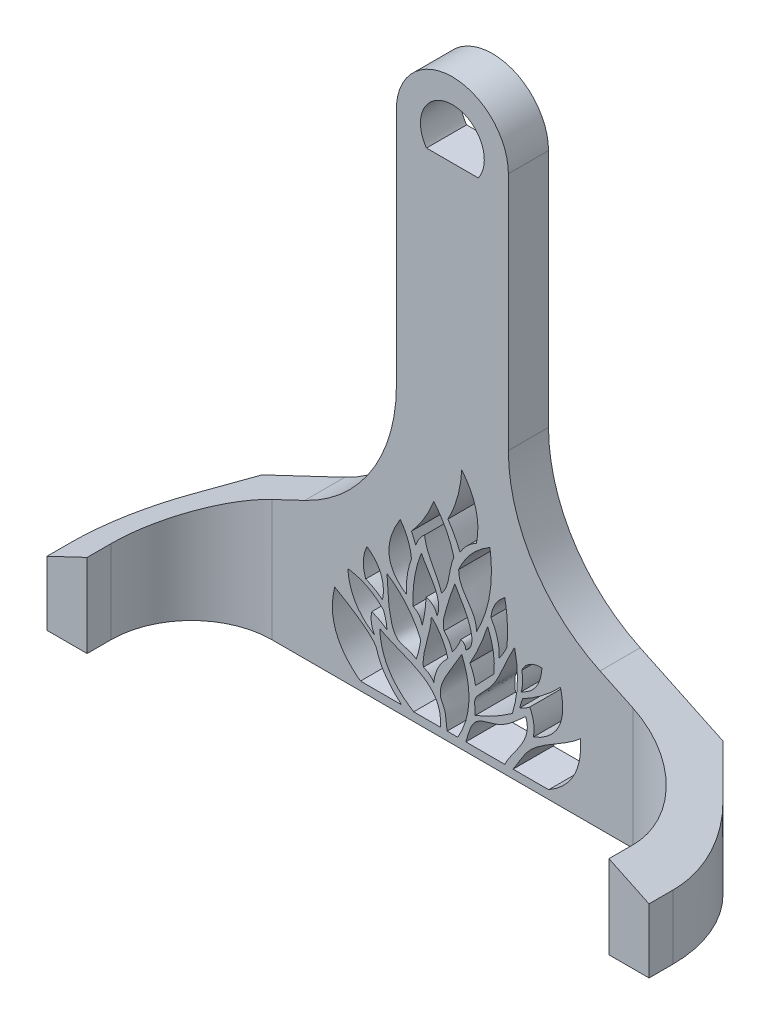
from build123d import *

# Parameters (mm, degrees)
BOSS_EXTRUDE1_DEPTH     = 10
BOSS_EXTRUDE3_DEPTH     = 26
FILLET1_R               = 20
CUT_EXTRUDE1_DEPTH      = 167.260646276
CUT_EXTRUDE3_DEPTH      = 165.385530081
CUT_EXTRUDE3_DEPTH_BACK = 165.385530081


with BuildPart() as part:
    # Sketch1 → Boss-Extrude1 (new body)
    with BuildSketch(Plane.XY):
        with BuildLine():
            Line((-75, 0), (75, 0))
            Line((75, 0), (75, 16))
            Line((75, 16), (36.787123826, 34.151898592))
            ThreePointArc((36.787123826, 34.151898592), (20.13790862, 48.911177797), (13.95, 70.282712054))
            Line((13.95, 70.282712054), (13.95, 130))
            ThreePointArc((13.95, 130), (0, 143.95), (-13.95, 130))
            Line((-13.95, 130), (-13.95, 70.282712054))
            ThreePointArc((-13.95, 70.282712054), (-20.13790862, 48.911177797), (-36.787123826, 34.151898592))
            Line((-36.787123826, 34.151898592), (-75, 16))
            Line((-75, 16), (-75, 0))
        make_face()
        with BuildLine():
            Line((6.448255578, 125.35), (-6.448255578, 125.35))
            ThreePointArc((-6.448255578, 125.35), (0, 137.95), (6.448255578, 125.35))
        make_face(mode=Mode.SUBTRACT)
    extrude(amount=BOSS_EXTRUDE1_DEPTH)

    # Sketch3 → Boss-Extrude3 (add)
    with BuildSketch(Plane.XY.offset(10)):
        Polygon((-65, 20.75020475), (-65, 0), (-75, 0), (-75, 16), align=None)
        Polygon((65, 20.75020475), (65, 0), (75, 0), (75, 16), align=None)
    extrude(amount=BOSS_EXTRUDE3_DEPTH)

    # Fillet1
    fillet1_edges = [part.edges().sort_by_distance(p)[0] for p in [
        (-65, 10.375102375, 10),
        (65, 10.375102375, 10),
    ]]
    fillet(fillet1_edges, radius=FILLET1_R)

    # Sketch4 → Cut-Extrude1 (cut, through all)
    with BuildSketch(Plane.XZ):
        with BuildLine():
            Line((57.426406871, 0), (66.213203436, 8.786796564))
            ThreePointArc((66.213203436, 8.786796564), (72.716385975, 18.519497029), (75, 30))
            Line((75, 30), (75, 0))
            Line((75, 0), (57.426406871, 0))
        make_face()
        with BuildLine():
            Line((-57.426406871, 0), (-66.213203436, 8.786796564))
            ThreePointArc((-66.213203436, 8.786796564), (-72.716385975, 18.519497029), (-75, 30))
            Line((-75, 30), (-75, 0))
            Line((-75, 0), (-57.426406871, 0))
        make_face()
    extrude(amount=-CUT_EXTRUDE1_DEPTH, mode=Mode.SUBTRACT)

    # Sketch6 → Cut-Extrude3 (cut, two sides: drawn at the far end of the back side and taken through both)
    with BuildSketch(Plane.XY.offset(10).offset(-CUT_EXTRUDE3_DEPTH_BACK)):
        with BuildLine():
            Line((-9.63566394, 2.118822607), (-3.00934449, 2.118822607))
            add(Edge.make_bspline(
                [(-3.00934449, 2.118822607), (-2.107442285, 11.474091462), (-12.085295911, 12.52213364), (-18.097304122, 15.851318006)],
                knots=[0, 0, 0, 0, 1, 1, 1, 1], degree=3))
            add(Edge.make_bspline(
                [(-18.097304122, 15.851318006), (-17.803389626, 7.204871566), (-9.63566394, 2.118822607)],
                knots=[0, 0, 0, 1, 1, 1], degree=2))
        make_face()
        with BuildLine():
            Line((-1.30404169, 2.118822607), (1.351358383, 2.118822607))
            add(Edge.make_bspline(
                [(1.351358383, 2.118822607), (6.36439821, 10.813130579), (2.334063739, 20.500374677)],
                knots=[0, 0, 0, 1, 1, 1], degree=2))
            add(Edge.make_bspline(
                [(-1.30404169, 2.118822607), (-1.557133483, 3.493887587), (-1.53346335, 6.456941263), (-3.104096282, 8.349356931), (-2.851899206, 12.679161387), (-0.747048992, 15.064158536), (2.334063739, 20.500374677)],
                knots=[0, 0, 0, 0, 0.160123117, 0.338694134, 0.422681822, 1, 1, 1, 1], degree=3))
        make_face()
        with BuildLine():
            Line((3.348998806, 2.118822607), (13.053704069, 2.118822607))
            add(Edge.make_bspline(
                [(13.053704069, 2.118822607), (14.704324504, 5.91266318), (20.227331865, 10.265404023), (18.244398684, 15.019310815)],
                knots=[0, 0, 0, 0, 1, 1, 1, 1], degree=3))
            add(Edge.make_bspline(
                [(3.348998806, 2.118822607), (3.884552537, 3.785314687), (5.003478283, 8.701947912), (12.164916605, 9.253023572), (15.545270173, 12.633307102), (18.244398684, 15.019310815)],
                knots=[0, 0, 0, 0, 0.218875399, 0.535489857, 1, 1, 1, 1], degree=3))
        make_face()
        with BuildLine():
            Line((15.121579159, 2.118822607), (23.99307662, 2.118822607))
            add(Edge.make_bspline(
                [(31.877169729, 17.067352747), (32.64699268, 7.173438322), (23.99307662, 2.118822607)],
                knots=[0, 0, 0, 1, 1, 1], degree=2))
            add(Edge.make_bspline(
                [(15.121579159, 2.118822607), (17.083073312, 5.124506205), (19.642350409, 10.531443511), (28.671639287, 14.037293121), (31.877169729, 17.067352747)],
                knots=[0, 0, 0, 0, 0.346729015, 1, 1, 1, 1], degree=3))
        make_face()
        with BuildLine():
            Line((-12.687920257, 2.118822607), (-22.898361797, 2.118822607))
            add(Edge.make_bspline(
                [(-29.319313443, 19.211715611), (-31.923006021, 8.841688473), (-22.898361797, 2.118822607)],
                knots=[0, 0, 0, 1, 1, 1], degree=2))
            add(Edge.make_bspline(
                [(-12.687920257, 2.118822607), (-15.378895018, 4.403578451), (-18.780871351, 9.255832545), (-18.462334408, 12.773018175), (-26.982694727, 17.914095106), (-29.319313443, 19.211715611)],
                knots=[0, 0, 0, 0, 0.258366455, 0.490885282, 1, 1, 1, 1], degree=3))
        make_face()
        with BuildLine():
            add(Edge.make_bspline(
                [(5.690140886, 8.994319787), (10.625041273, 10.959076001), (14.945974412, 14.050568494)],
                knots=[0, 0, 0, 1, 1, 1], degree=2))
            add(Edge.make_bspline(
                [(14.945974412, 14.050568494), (17.164256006, 21.139416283), (15.50396234, 28.613757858)],
                knots=[0, 0, 0, 1, 1, 1], degree=2))
            add(Edge.make_bspline(
                [(5.690140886, 8.994319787), (5.62628895, 11.185426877), (5.028068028, 12.785265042), (11.686574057, 18.482902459), (12.321330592, 22.769787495), (15.50396234, 28.613757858)],
                knots=[0, 0, 0, 0, 0.19045518, 0.437917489, 1, 1, 1, 1], degree=3))
        make_face()
        with BuildLine():
            add(Edge.make_bspline(
                [(-9.003264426, 13.827680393), (-8.18216687, 16.104930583), (-7.892384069, 18.513860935)],
                knots=[0, 0, 0, 1, 1, 1], degree=2))
            add(Edge.make_bspline(
                [(-7.892384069, 18.513860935), (-10.498921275, 24.812030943), (-16.296372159, 28.613757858)],
                knots=[0, 0, 0, 1, 1, 1], degree=2))
            add(Edge.make_bspline(
                [(-9.003264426, 13.827680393), (-10.15668625, 14.490092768), (-11.10236929, 14.851242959), (-14.655906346, 15.626215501), (-15.972469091, 22.862472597), (-15.833288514, 21.380832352), (-16.296372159, 28.613757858)],
                knots=[0, 0, 0, 0, 0.147969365, 0.261474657, 0.535784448, 1, 1, 1, 1], degree=3))
        make_face()
        with BuildLine():
            add(Edge.make_bspline(
                [(-4.632858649, 10.960611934), (-4.166795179, 15.01903169), (-1.116121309, 17.874469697)],
                knots=[0, 0, 0, 1, 1, 1], degree=2))
            add(Edge.make_bspline(
                [(-1.116121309, 17.874469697), (-2.15951934, 21.917914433), (-5.235962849, 24.812490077)],
                knots=[0, 0, 0, 1, 1, 1], degree=2))
            add(Edge.make_bspline(
                [(-7.240507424, 12.935179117), (-7.55865817, 17.044414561), (-5.371009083, 20.747780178), (-5.235962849, 24.812490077)],
                knots=[0, 0, 0, 0, 1, 1, 1, 1], degree=3))
            add(Edge.make_bspline(
                [(-4.632858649, 10.960611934), (-5.55932734, 12.42152218), (-7.240507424, 12.935179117)],
                knots=[0, 0, 0, 1, 1, 1], degree=2))
        make_face()
        with BuildLine():
            add(Edge.make_bspline(
                [(-7.540124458, 21.713058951), (-6.678695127, 24.991837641), (-6.55986475, 28.39211662)],
                knots=[0, 0, 0, 1, 1, 1], degree=2))
            add(Edge.make_bspline(
                [(-6.55986475, 28.39211662), (-4.358116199, 27.916353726), (-3.831425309, 25.683941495)],
                knots=[0, 0, 0, 1, 1, 1], degree=2))
            add(Edge.make_bspline(
                [(-7.722884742, 37.314141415), (-6.098573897, 33.938948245), (-2.075605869, 29.885260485), (-3.831425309, 25.683941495)],
                knots=[0, 0, 0, 0, 1, 1, 1, 1], degree=3))
            add(Edge.make_bspline(
                [(-9.749862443, 24.812490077), (-10.154023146, 31.234950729), (-7.722884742, 37.314141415)],
                knots=[0, 0, 0, 1, 1, 1], degree=2))
            add(Edge.make_bspline(
                [(-7.540124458, 21.713058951), (-7.830937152, 23.81400726), (-9.749862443, 24.812490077)],
                knots=[0, 0, 0, 1, 1, 1], degree=2))
        make_face()
        with BuildLine():
            add(Edge.make_bspline(
                [(0, 19.818997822), (1.342731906, 21.551597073), (2.112941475, 23.607120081)],
                knots=[0, 0, 0, 1, 1, 1], degree=2))
            add(Edge.make_bspline(
                [(2.112941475, 23.607120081), (3.224339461, 23.289279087), (3.348998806, 21.929048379)],
                knots=[0, 0, 0, 1, 1, 1], degree=2))
            add(Edge.make_bspline(
                [(3.348998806, 21.929048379), (6.009718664, 23.618845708), (3.455361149, 30.223432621), (2.445145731, 31.677799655), (0.617630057, 34.855184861)],
                knots=[0, 0, 0, 0, 0.567372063, 1, 1, 1, 1], degree=3))
            add(Edge.make_bspline(
                [(0.617630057, 34.855184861), (-0.503306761, 32.116143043), (-1.13003102, 29.323218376), (-2.621745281, 25.075703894), (-2.040701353, 23.391130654)],
                knots=[0, 0, 0, 0, 0.561677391, 1, 1, 1, 1], degree=3))
            add(Edge.make_bspline(
                [(0, 19.818997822), (-0.599568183, 21.837971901), (-2.040701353, 23.391130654)],
                knots=[0, 0, 0, 1, 1, 1], degree=2))
        make_face()
        with BuildLine():
            add(Edge.make_bspline(
                [(5.770626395, 15.467477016), (5.437006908, 17.674577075), (4.372476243, 19.636418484)],
                knots=[0, 0, 0, 1, 1, 1], degree=2))
            add(Edge.make_bspline(
                [(4.372476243, 19.636418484), (7.082750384, 24.463817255), (8.785691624, 29.749358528)],
                knots=[0, 0, 0, 1, 1, 1], degree=2))
            add(Edge.make_bspline(
                [(10.391226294, 20.304100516), (10.77233566, 25.209870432), (8.785691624, 29.749358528)],
                knots=[0, 0, 0, 1, 1, 1], degree=2))
            add(Edge.make_bspline(
                [(5.770626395, 15.467477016), (8.056920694, 17.908727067), (10.391226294, 20.304100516)],
                knots=[0, 0, 0, 1, 1, 1], degree=2))
        make_face()
        with BuildLine():
            add(Edge.make_bspline(
                [(20.16865034, 11.556709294), (20.772318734, 14.689064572), (19.294060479, 17.61708746)],
                knots=[0, 0, 0, 1, 1, 1], degree=2))
            add(Edge.make_bspline(
                [(19.294060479, 17.61708746), (18.155886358, 16.696594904), (16.789480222, 16.160534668)],
                knots=[0, 0, 0, 1, 1, 1], degree=2))
            add(Edge.make_bspline(
                [(16.789480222, 16.160534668), (17.028541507, 17.376555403), (17.517382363, 18.513860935)],
                knots=[0, 0, 0, 1, 1, 1], degree=2))
            add(Edge.make_bspline(
                [(17.517382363, 18.513860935), (22.786319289, 21.353600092), (26.91916615, 25.683941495)],
                knots=[0, 0, 0, 1, 1, 1], degree=2))
            add(Edge.make_bspline(
                [(20.16865034, 11.556709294), (29.508113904, 15.418374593), (26.91916615, 25.683941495)],
                knots=[0, 0, 0, 1, 1, 1], degree=2))
        make_face()
        with BuildLine():
            add(Edge.make_bspline(
                [(-19.411182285, 13.827680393), (-20.626646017, 16.056751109), (-20.076926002, 18.513860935)],
                knots=[0, 0, 0, 1, 1, 1], degree=2))
            add(Edge.make_bspline(
                [(-20.076926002, 18.513860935), (-18.03999505, 17.76911006), (-16.296372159, 16.47075049)],
                knots=[0, 0, 0, 1, 1, 1], degree=2))
            add(Edge.make_bspline(
                [(-16.296372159, 16.47075049), (-16.408185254, 18.451513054), (-17.153088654, 20.304100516)],
                knots=[0, 0, 0, 1, 1, 1], degree=2))
            add(Edge.make_bspline(
                [(-26.069632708, 24.812490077), (-20.809584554, 24.154923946), (-17.153088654, 20.304100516)],
                knots=[0, 0, 0, 1, 1, 1], degree=2))
            add(Edge.make_bspline(
                [(-19.411182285, 13.827680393), (-25.493077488, 17.527518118), (-26.069632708, 24.812490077)],
                knots=[0, 0, 0, 1, 1, 1], degree=2))
        make_face()
        with BuildLine():
            add(Edge.make_bspline(
                [(-17.400273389, 22.370353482), (-19.312730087, 23.90216387), (-21.573811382, 24.812490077)],
                knots=[0, 0, 0, 1, 1, 1], degree=2))
            add(Edge.make_bspline(
                [(-21.573811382, 24.812490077), (-22.929444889, 28.388227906), (-21.279216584, 31.986234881)],
                knots=[0, 0, 0, 1, 1, 1], degree=2))
            add(Edge.make_bspline(
                [(-17.400273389, 22.370353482), (-16.284608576, 28.324808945), (-21.279216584, 31.986234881)],
                knots=[0, 0, 0, 1, 1, 1], degree=2))
        make_face()
        with BuildLine():
            add(Edge.make_bspline(
                [(-11.479537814, 26.580089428), (-19.282956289, 31.74701938), (-13.002466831, 41.972179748)],
                knots=[0, 0, 0, 1, 1, 1], degree=2))
            add(Edge.make_bspline(
                [(-10.175819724, 34.855184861), (-10.632222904, 38.821776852), (-13.002466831, 41.972179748)],
                knots=[0, 0, 0, 1, 1, 1], degree=2))
            add(Edge.make_bspline(
                [(-11.479537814, 26.580089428), (-11.677422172, 30.829608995), (-10.175819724, 34.855184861)],
                knots=[0, 0, 0, 1, 1, 1], degree=2))
        make_face()
        with BuildLine():
            add(Edge.make_bspline(
                [(17.127985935, 19.818997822), (21.9809656, 21.85275881), (22.301431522, 27.561388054)],
                knots=[0, 0, 0, 1, 1, 1], degree=2))
            add(Edge.make_bspline(
                [(17.287680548, 24.554466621), (18.766842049, 27.59748071), (22.301431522, 27.561388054)],
                knots=[0, 0, 0, 1, 1, 1], degree=2))
            add(Edge.make_bspline(
                [(17.127985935, 19.818997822), (17.818027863, 22.172490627), (17.287680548, 24.554466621)],
                knots=[0, 0, 0, 1, 1, 1], degree=2))
        make_face()
        with BuildLine():
            add(Edge.make_bspline(
                [(11.658094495, 24.355872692), (12.841459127, 25.91881651), (13.611946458, 27.720839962)],
                knots=[0, 0, 0, 1, 1, 1], degree=2))
            add(Edge.make_bspline(
                [(13.611946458, 27.720839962), (14.093493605, 32.915838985), (13.053704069, 38.093313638)],
                knots=[0, 0, 0, 1, 1, 1], degree=2))
            add(Edge.make_bspline(
                [(9.601344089, 32.104613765), (10.015649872, 35.839491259), (13.053704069, 38.093313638)],
                knots=[0, 0, 0, 1, 1, 1], degree=2))
            add(Edge.make_bspline(
                [(11.658094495, 24.355872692), (11.845337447, 28.47430656), (9.601344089, 32.104613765)],
                knots=[0, 0, 0, 1, 1, 1], degree=2))
        make_face()
        with BuildLine():
            add(Edge.make_bspline(
                [(5.989160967, 27.159983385), (10.895468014, 36.376673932), (9.361643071, 47.088178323)],
                knots=[0, 0, 0, 1, 1, 1], degree=2))
            add(Edge.make_bspline(
                [(1.580979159, 38.447961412), (4.029105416, 43.993256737), (9.361643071, 47.088178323)],
                knots=[0, 0, 0, 1, 1, 1], degree=2))
            add(Edge.make_bspline(
                [(5.989160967, 27.159983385), (6.151053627, 31.667896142), (1.40948818, 33.961177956), (1.580979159, 38.447961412)],
                knots=[0, 0, 0, 0, 1, 1, 1, 1], degree=3))
        make_face()
        with BuildLine():
            add(Edge.make_bspline(
                [(-2.673704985, 31.191148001), (-0.959508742, 33.192920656), (-0.868883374, 36.69043128), (0.059638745, 39.734405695), (0.366990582, 40.46982013)],
                knots=[0, 0, 0, 0, 0.495159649, 0.657507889, 0.657507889, 0.657507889, 0.657507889], degree=3))
            add(Edge.make_bspline(
                [(0.366990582, 40.46982013), (-1.015978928, 45.796849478), (-4.632858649, 49.959618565)],
                knots=[0, 0, 0, 1, 1, 1], degree=2))
            add(Edge.make_bspline(
                [(-10.175819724, 40.827758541), (-6.635399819, 44.914494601), (-4.632858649, 49.959618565)],
                knots=[0, 0, 0, 1, 1, 1], degree=2))
            add(Edge.make_bspline(
                [(-9.107576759, 38.306138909), (-9.601163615, 39.58460284), (-10.175819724, 40.827758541)],
                knots=[0, 0, 0, 1, 1, 1], degree=2))
            add(Edge.make_bspline(
                [(-6.925512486, 41.616419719), (-8.514868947, 40.280641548), (-9.107576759, 38.306138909)],
                knots=[0, 0, 0, 1, 1, 1], degree=2))
            add(Edge.make_bspline(
                [(-2.673704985, 31.191148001), (-3.804018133, 34.804167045), (-6.510465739, 37.730328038), (-6.925512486, 41.616419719)],
                knots=[0, 0, 0, 0, 1, 1, 1, 1], degree=3))
        make_face()
        with BuildLine():
            add(Edge.make_bspline(
                [(1.892660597, 42.287060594), (3.388897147, 44.857259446), (5.989160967, 46.282755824)],
                knots=[0, 0, 0, 1, 1, 1], degree=2))
            add(Edge.make_bspline(
                [(5.989160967, 46.282755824), (7.569112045, 53.822495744), (2.334063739, 60.321087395)],
                knots=[0, 0, 0, 1, 1, 1], degree=2))
            add(Edge.make_bspline(
                [(-1.116121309, 47.952567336), (1.96080196, 53.704161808), (2.334063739, 60.321087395)],
                knots=[0, 0, 0, 1, 1, 1], degree=2))
            add(Edge.make_bspline(
                [(1.892660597, 42.287060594), (0.698933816, 45.295007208), (-1.116121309, 47.952567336)],
                knots=[0, 0, 0, 1, 1, 1], degree=2))
        make_face()
    extrude(amount=CUT_EXTRUDE3_DEPTH + CUT_EXTRUDE3_DEPTH_BACK, mode=Mode.SUBTRACT)


solid = part.part
